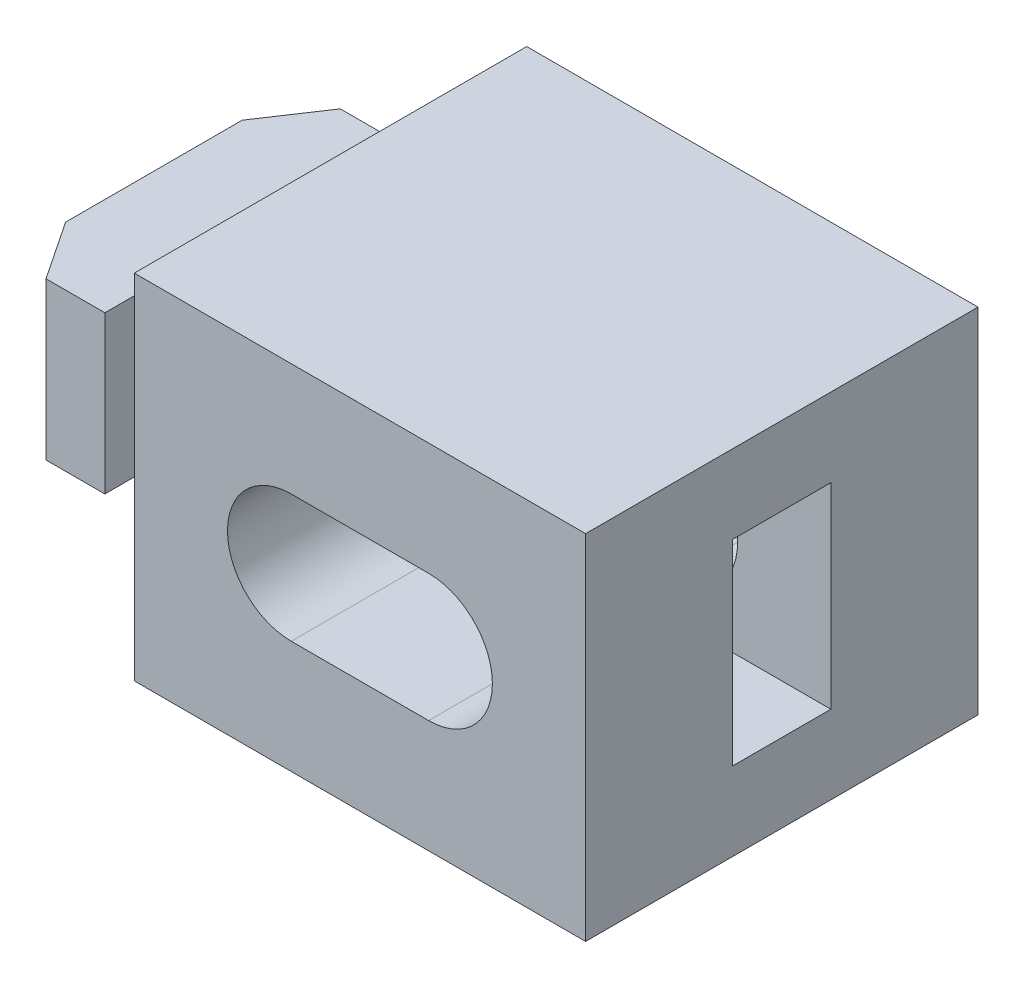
from build123d import *

# Parameters (mm, degrees)
SKETCH_1_W          = 23
SKETCH_1_H          = 18
EXTRUDE_1_DEPTH     = 10
SKETCH_2_W          = 5
SKETCH_2_H          = 10
CUT_EXTRUDE_1_DEPTH = 20
SKETCH_3_W          = 15
SKETCH_3_H          = 8
EXTRUDE_2_DEPTH     = 9
CUT_EXTRUDE_2_REACH = 28.254
SKETCH_4_W          = 4
SKETCH_4_H          = 3.5
FILLET_1_R          = 3
CUT_EXTRUDE_3_DEPTH = 9


with BuildPart() as part:
    # Sketch 1 → Extrude 1 (new, symmetric)
    with BuildSketch(Plane.XY):
        Rectangle(SKETCH_1_W, SKETCH_1_H)
        with BuildLine():
            Line((-3.5, 3.25), (3.5, 3.25))
            ThreePointArc((3.5, 3.25), (6.75, 0), (3.5, -3.25))
            Line((3.5, -3.25), (-3.5, -3.25))
            ThreePointArc((-3.5, -3.25), (-6.75, 0), (-3.5, 3.25))
        make_face(mode=Mode.SUBTRACT)
    extrude(amount=EXTRUDE_1_DEPTH, both=True)

    # Sketch 2 → Cut-Extrude 1 (cut)
    with BuildSketch(Plane(origin=(11.5, 0, 0), x_dir=(0, 0, -1), z_dir=(1, 0, 0))):
        Rectangle(SKETCH_2_W, SKETCH_2_H)
    extrude(amount=-CUT_EXTRUDE_1_DEPTH, mode=Mode.SUBTRACT)

    # Sketch 3 → Extrude 2 (add)
    with BuildSketch(Plane.ZY.offset(11.5)):
        Rectangle(SKETCH_3_W, SKETCH_3_H)
    extrude(amount=EXTRUDE_2_DEPTH)

    # Sketch 4 → Cut-Extrude 2 (cut, up to next)
    with BuildSketch(Plane.XZ.offset(4), mode=Mode.PRIVATE) as cut_extrude_2_sk1:
        with Locations((-13.5, 5.75)):
            Rectangle(SKETCH_4_W, SKETCH_4_H)
    cut_extrude_2_tool1 = extrude(cut_extrude_2_sk1.sketch, amount=-CUT_EXTRUDE_2_REACH, mode=Mode.PRIVATE) & part.part
    cut_extrude_2 = cut_extrude_2_tool1.solids().sort_by_distance((-13.5, -4, 5.75))[0]
    add(cut_extrude_2, mode=Mode.SUBTRACT)

    # Mirror 1: Cut-Extrude 2 across plane
    add(cut_extrude_2.mirror(Plane.XY), mode=Mode.SUBTRACT)

    # Fillet 1
    fillet_1_edges = [part.edges().sort_by_distance(p)[0] for p in [
        (-13.5, 4, 4),
        (-13.5, -4, -4),
    ]]
    fillet(fillet_1_edges, radius=FILLET_1_R)

    # Sketch 5 → Cut-Extrude 3 (cut)
    with BuildSketch(Plane.XZ.offset(4)):
        Polygon((-18.5, 7.5), (-20.5, 7.5), (-20.5, 4.5), align=None)
    cut_extrude_3 = extrude(amount=-CUT_EXTRUDE_3_DEPTH, mode=Mode.SUBTRACT)

    # Mirror 2: Cut-Extrude 3 across plane
    add(cut_extrude_3.mirror(Plane.XY), mode=Mode.SUBTRACT)


solid = part.part
